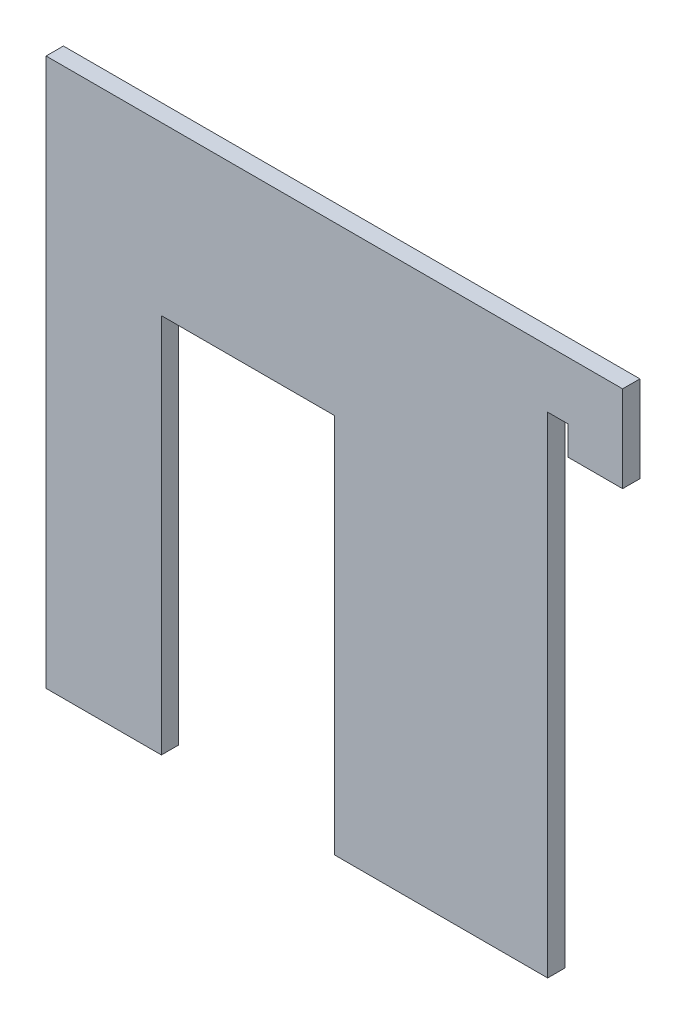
ISO-10303-21;
HEADER;
FILE_DESCRIPTION(('STEP AP214'),'2;1');
FILE_NAME('part.step','',(''),(''),'','','');
FILE_SCHEMA(('AUTOMOTIVE_DESIGN { 1 0 10303 214 1 1 1 1 }'));
ENDSEC;
DATA;
#1=APPLICATION_CONTEXT('core data for automotive mechanical design processes');
#2=APPLICATION_PROTOCOL_DEFINITION('international standard','automotive_design',2000,#1);
#3=PRODUCT_CONTEXT('',#1,'mechanical');
#4=PRODUCT('Part','Part','',(#3));
#5=PRODUCT_RELATED_PRODUCT_CATEGORY('part','',(#4));
#6=PRODUCT_DEFINITION_FORMATION('','',#4);
#7=PRODUCT_DEFINITION_CONTEXT('part definition',#1,'design');
#8=PRODUCT_DEFINITION('design','',#6,#7);
#9=PRODUCT_DEFINITION_SHAPE('','',#8);
#10=(LENGTH_UNIT() NAMED_UNIT(*) SI_UNIT(.MILLI.,.METRE.));
#11=(NAMED_UNIT(*) PLANE_ANGLE_UNIT() SI_UNIT($,.RADIAN.));
#12=(NAMED_UNIT(*) SI_UNIT($,.STERADIAN.) SOLID_ANGLE_UNIT());
#13=UNCERTAINTY_MEASURE_WITH_UNIT(LENGTH_MEASURE(1.E-05),#10,'distance_accuracy_value','');
#14=(GEOMETRIC_REPRESENTATION_CONTEXT(3) GLOBAL_UNCERTAINTY_ASSIGNED_CONTEXT((#13)) GLOBAL_UNIT_ASSIGNED_CONTEXT((#10,
#11,#12)) REPRESENTATION_CONTEXT('',''));
#15=CARTESIAN_POINT('',(0.,0.,0.));
#16=DIRECTION('',(0.,0.,1.));
#17=DIRECTION('',(1.,0.,0.));
#18=AXIS2_PLACEMENT_3D('',#15,#16,#17);
#19=CARTESIAN_POINT('',(0.,0.,3.));
#20=DIRECTION('',(0.,1.,0.));
#21=DIRECTION('',(0.,0.,1.));
#22=AXIS2_PLACEMENT_3D('',#19,#20,#21);
#23=PLANE('',#22);
#24=DIRECTION('',(1.,0.,0.));
#25=VECTOR('',#24,1.);
#26=CARTESIAN_POINT('',(0.,0.,0.));
#27=LINE('',#26,#25);
#28=CARTESIAN_POINT('',(0.,0.,0.));
#29=VERTEX_POINT('',#28);
#30=CARTESIAN_POINT('',(20.,0.,0.));
#31=VERTEX_POINT('',#30);
#32=EDGE_CURVE('E202',#29,#31,#27,.T.);
#33=ORIENTED_EDGE('',*,*,#32,.T.);
#34=DIRECTION('',(0.,0.,1.));
#35=VECTOR('',#34,1.);
#36=CARTESIAN_POINT('',(20.,0.,0.));
#37=LINE('',#36,#35);
#38=CARTESIAN_POINT('',(20.,0.,3.));
#39=VERTEX_POINT('',#38);
#40=EDGE_CURVE('E170',#31,#39,#37,.T.);
#41=ORIENTED_EDGE('',*,*,#40,.T.);
#42=DIRECTION('',(1.,0.,0.));
#43=VECTOR('',#42,1.);
#44=CARTESIAN_POINT('',(0.,0.,3.));
#45=LINE('',#44,#43);
#46=CARTESIAN_POINT('',(0.,0.,3.));
#47=VERTEX_POINT('',#46);
#48=EDGE_CURVE('E191',#47,#39,#45,.T.);
#49=ORIENTED_EDGE('',*,*,#48,.F.);
#50=DIRECTION('',(0.,0.,-1.));
#51=VECTOR('',#50,1.);
#52=CARTESIAN_POINT('',(0.,0.,3.));
#53=LINE('',#52,#51);
#54=EDGE_CURVE('E11',#47,#29,#53,.T.);
#55=ORIENTED_EDGE('',*,*,#54,.T.);
#56=EDGE_LOOP('',(#33,#41,#49,#55));
#57=FACE_BOUND('',#56,.T.);
#58=ADVANCED_FACE('F31',(#57),#23,.F.);
#59=CARTESIAN_POINT('',(0.,0.,3.));
#60=DIRECTION('',(1.,0.,0.));
#61=DIRECTION('',(0.,0.,-1.));
#62=AXIS2_PLACEMENT_3D('',#59,#60,#61);
#63=PLANE('',#62);
#64=DIRECTION('',(0.,-1.,0.));
#65=VECTOR('',#64,1.);
#66=CARTESIAN_POINT('',(0.,0.,0.));
#67=LINE('',#66,#65);
#68=CARTESIAN_POINT('',(0.,95.,0.));
#69=VERTEX_POINT('',#68);
#70=EDGE_CURVE('E179',#69,#29,#67,.T.);
#71=ORIENTED_EDGE('',*,*,#70,.T.);
#72=ORIENTED_EDGE('',*,*,#54,.F.);
#73=DIRECTION('',(0.,-1.,0.));
#74=VECTOR('',#73,1.);
#75=CARTESIAN_POINT('',(0.,0.,3.));
#76=LINE('',#75,#74);
#77=CARTESIAN_POINT('',(0.,95.,3.));
#78=VERTEX_POINT('',#77);
#79=EDGE_CURVE('E186',#78,#47,#76,.T.);
#80=ORIENTED_EDGE('',*,*,#79,.F.);
#81=DIRECTION('',(0.,0.,-1.));
#82=VECTOR('',#81,1.);
#83=CARTESIAN_POINT('',(0.,95.,3.));
#84=LINE('',#83,#82);
#85=EDGE_CURVE('E198',#78,#69,#84,.T.);
#86=ORIENTED_EDGE('',*,*,#85,.T.);
#87=EDGE_LOOP('',(#71,#72,#80,#86));
#88=FACE_BOUND('',#87,.T.);
#89=ADVANCED_FACE('F33',(#88),#63,.F.);
#90=CARTESIAN_POINT('',(50.,0.,0.));
#91=VERTEX_POINT('',#90);
#92=CARTESIAN_POINT('',(87.,0.,0.));
#93=VERTEX_POINT('',#92);
#94=EDGE_CURVE('E201',#91,#93,#27,.T.);
#95=ORIENTED_EDGE('',*,*,#94,.T.);
#96=DIRECTION('',(0.,0.,1.));
#97=VECTOR('',#96,1.);
#98=CARTESIAN_POINT('',(87.,0.,0.));
#99=LINE('',#98,#97);
#100=CARTESIAN_POINT('',(87.,0.,3.));
#101=VERTEX_POINT('',#100);
#102=EDGE_CURVE('E153',#93,#101,#99,.T.);
#103=ORIENTED_EDGE('',*,*,#102,.T.);
#104=CARTESIAN_POINT('',(50.,0.,3.));
#105=VERTEX_POINT('',#104);
#106=EDGE_CURVE('E189',#105,#101,#45,.T.);
#107=ORIENTED_EDGE('',*,*,#106,.F.);
#108=DIRECTION('',(0.,0.,1.));
#109=VECTOR('',#108,1.);
#110=CARTESIAN_POINT('',(50.,0.,0.));
#111=LINE('',#110,#109);
#112=EDGE_CURVE('E182',#91,#105,#111,.T.);
#113=ORIENTED_EDGE('',*,*,#112,.F.);
#114=EDGE_LOOP('',(#95,#103,#107,#113));
#115=FACE_BOUND('',#114,.T.);
#116=ADVANCED_FACE('F239',(#115),#23,.F.);
#117=CARTESIAN_POINT('',(100.,0.,3.));
#118=DIRECTION('',(-1.,0.,0.));
#119=DIRECTION('',(0.,0.,1.));
#120=AXIS2_PLACEMENT_3D('',#117,#118,#119);
#121=PLANE('',#120);
#122=DIRECTION('',(0.,1.,0.));
#123=VECTOR('',#122,1.);
#124=CARTESIAN_POINT('',(100.,0.,3.));
#125=LINE('',#124,#123);
#126=CARTESIAN_POINT('',(100.,80.,3.));
#127=VERTEX_POINT('',#126);
#128=CARTESIAN_POINT('',(100.,95.,3.));
#129=VERTEX_POINT('',#128);
#130=EDGE_CURVE('E194',#127,#129,#125,.T.);
#131=ORIENTED_EDGE('',*,*,#130,.F.);
#132=DIRECTION('',(0.,0.,1.));
#133=VECTOR('',#132,1.);
#134=CARTESIAN_POINT('',(100.,80.,0.));
#135=LINE('',#134,#133);
#136=CARTESIAN_POINT('',(100.,80.,0.));
#137=VERTEX_POINT('',#136);
#138=EDGE_CURVE('E157',#137,#127,#135,.T.);
#139=ORIENTED_EDGE('',*,*,#138,.F.);
#140=DIRECTION('',(0.,1.,0.));
#141=VECTOR('',#140,1.);
#142=CARTESIAN_POINT('',(100.,0.,0.));
#143=LINE('',#142,#141);
#144=CARTESIAN_POINT('',(100.,95.,0.));
#145=VERTEX_POINT('',#144);
#146=EDGE_CURVE('E205',#137,#145,#143,.T.);
#147=ORIENTED_EDGE('',*,*,#146,.T.);
#148=DIRECTION('',(0.,0.,-1.));
#149=VECTOR('',#148,1.);
#150=CARTESIAN_POINT('',(100.,95.,3.));
#151=LINE('',#150,#149);
#152=EDGE_CURVE('E39',#129,#145,#151,.T.);
#153=ORIENTED_EDGE('',*,*,#152,.F.);
#154=EDGE_LOOP('',(#131,#139,#147,#153));
#155=FACE_BOUND('',#154,.T.);
#156=ADVANCED_FACE('F227',(#155),#121,.F.);
#157=CARTESIAN_POINT('',(0.,95.,3.));
#158=DIRECTION('',(0.,-1.,0.));
#159=DIRECTION('',(0.,0.,-1.));
#160=AXIS2_PLACEMENT_3D('',#157,#158,#159);
#161=PLANE('',#160);
#162=DIRECTION('',(-1.,0.,0.));
#163=VECTOR('',#162,1.);
#164=CARTESIAN_POINT('',(0.,95.,0.));
#165=LINE('',#164,#163);
#166=EDGE_CURVE('E190',#145,#69,#165,.T.);
#167=ORIENTED_EDGE('',*,*,#166,.T.);
#168=ORIENTED_EDGE('',*,*,#85,.F.);
#169=DIRECTION('',(-1.,0.,0.));
#170=VECTOR('',#169,1.);
#171=CARTESIAN_POINT('',(0.,95.,3.));
#172=LINE('',#171,#170);
#173=EDGE_CURVE('E196',#129,#78,#172,.T.);
#174=ORIENTED_EDGE('',*,*,#173,.F.);
#175=ORIENTED_EDGE('',*,*,#152,.T.);
#176=EDGE_LOOP('',(#167,#168,#174,#175));
#177=FACE_BOUND('',#176,.T.);
#178=ADVANCED_FACE('F214',(#177),#161,.F.);
#179=CARTESIAN_POINT('',(0.,95.,3.));
#180=DIRECTION('',(0.,0.,-1.));
#181=DIRECTION('',(-1.,0.,0.));
#182=AXIS2_PLACEMENT_3D('',#179,#180,#181);
#183=PLANE('',#182);
#184=DIRECTION('',(0.,-1.,0.));
#185=VECTOR('',#184,1.);
#186=CARTESIAN_POINT('',(87.,0.,3.));
#187=LINE('',#186,#185);
#188=CARTESIAN_POINT('',(87.,85.,3.));
#189=VERTEX_POINT('',#188);
#190=EDGE_CURVE('E146',#189,#101,#187,.T.);
#191=ORIENTED_EDGE('',*,*,#190,.F.);
#192=DIRECTION('',(-1.,0.,0.));
#193=VECTOR('',#192,1.);
#194=CARTESIAN_POINT('',(87.,85.,3.));
#195=LINE('',#194,#193);
#196=CARTESIAN_POINT('',(90.5,85.,3.));
#197=VERTEX_POINT('',#196);
#198=EDGE_CURVE('E141',#197,#189,#195,.T.);
#199=ORIENTED_EDGE('',*,*,#198,.F.);
#200=DIRECTION('',(0.,1.,0.));
#201=VECTOR('',#200,1.);
#202=CARTESIAN_POINT('',(90.5,80.,3.));
#203=LINE('',#202,#201);
#204=CARTESIAN_POINT('',(90.5,80.,3.));
#205=VERTEX_POINT('',#204);
#206=EDGE_CURVE('E122',#205,#197,#203,.T.);
#207=ORIENTED_EDGE('',*,*,#206,.F.);
#208=DIRECTION('',(-1.,0.,0.));
#209=VECTOR('',#208,1.);
#210=CARTESIAN_POINT('',(87.,80.,3.));
#211=LINE('',#210,#209);
#212=EDGE_CURVE('E151',#127,#205,#211,.T.);
#213=ORIENTED_EDGE('',*,*,#212,.F.);
#214=ORIENTED_EDGE('',*,*,#130,.T.);
#215=ORIENTED_EDGE('',*,*,#173,.T.);
#216=ORIENTED_EDGE('',*,*,#79,.T.);
#217=ORIENTED_EDGE('',*,*,#48,.T.);
#218=DIRECTION('',(0.,-1.,0.));
#219=VECTOR('',#218,1.);
#220=CARTESIAN_POINT('',(20.,0.,3.));
#221=LINE('',#220,#219);
#222=CARTESIAN_POINT('',(20.,66.,3.));
#223=VERTEX_POINT('',#222);
#224=EDGE_CURVE('E159',#223,#39,#221,.T.);
#225=ORIENTED_EDGE('',*,*,#224,.F.);
#226=DIRECTION('',(-1.,0.,0.));
#227=VECTOR('',#226,1.);
#228=CARTESIAN_POINT('',(20.,66.,3.));
#229=LINE('',#228,#227);
#230=CARTESIAN_POINT('',(50.,66.,3.));
#231=VERTEX_POINT('',#230);
#232=EDGE_CURVE('E166',#231,#223,#229,.T.);
#233=ORIENTED_EDGE('',*,*,#232,.F.);
#234=DIRECTION('',(0.,1.,0.));
#235=VECTOR('',#234,1.);
#236=CARTESIAN_POINT('',(50.,0.,3.));
#237=LINE('',#236,#235);
#238=EDGE_CURVE('E172',#105,#231,#237,.T.);
#239=ORIENTED_EDGE('',*,*,#238,.F.);
#240=ORIENTED_EDGE('',*,*,#106,.T.);
#241=EDGE_LOOP('',(#191,#199,#207,#213,#214,#215,#216,#217,#225,#233,#239,#240));
#242=FACE_BOUND('',#241,.T.);
#243=ADVANCED_FACE('F223',(#242),#183,.F.);
#244=CARTESIAN_POINT('',(0.,95.,0.));
#245=DIRECTION('',(0.,0.,-1.));
#246=DIRECTION('',(-1.,0.,0.));
#247=AXIS2_PLACEMENT_3D('',#244,#245,#246);
#248=PLANE('',#247);
#249=DIRECTION('',(-1.,0.,0.));
#250=VECTOR('',#249,1.);
#251=CARTESIAN_POINT('',(87.,85.,0.));
#252=LINE('',#251,#250);
#253=CARTESIAN_POINT('',(90.5,85.,0.));
#254=VERTEX_POINT('',#253);
#255=CARTESIAN_POINT('',(87.,85.,0.));
#256=VERTEX_POINT('',#255);
#257=EDGE_CURVE('E131',#254,#256,#252,.T.);
#258=ORIENTED_EDGE('',*,*,#257,.T.);
#259=DIRECTION('',(0.,-1.,0.));
#260=VECTOR('',#259,1.);
#261=CARTESIAN_POINT('',(87.,0.,0.));
#262=LINE('',#261,#260);
#263=EDGE_CURVE('E149',#256,#93,#262,.T.);
#264=ORIENTED_EDGE('',*,*,#263,.T.);
#265=ORIENTED_EDGE('',*,*,#94,.F.);
#266=DIRECTION('',(0.,1.,0.));
#267=VECTOR('',#266,1.);
#268=CARTESIAN_POINT('',(50.,0.,0.));
#269=LINE('',#268,#267);
#270=CARTESIAN_POINT('',(50.,66.,0.));
#271=VERTEX_POINT('',#270);
#272=EDGE_CURVE('E165',#91,#271,#269,.T.);
#273=ORIENTED_EDGE('',*,*,#272,.T.);
#274=DIRECTION('',(-1.,0.,0.));
#275=VECTOR('',#274,1.);
#276=CARTESIAN_POINT('',(20.,66.,0.));
#277=LINE('',#276,#275);
#278=CARTESIAN_POINT('',(20.,66.,0.));
#279=VERTEX_POINT('',#278);
#280=EDGE_CURVE('E54',#271,#279,#277,.T.);
#281=ORIENTED_EDGE('',*,*,#280,.T.);
#282=DIRECTION('',(0.,-1.,0.));
#283=VECTOR('',#282,1.);
#284=CARTESIAN_POINT('',(20.,0.,0.));
#285=LINE('',#284,#283);
#286=EDGE_CURVE('E162',#279,#31,#285,.T.);
#287=ORIENTED_EDGE('',*,*,#286,.T.);
#288=ORIENTED_EDGE('',*,*,#32,.F.);
#289=ORIENTED_EDGE('',*,*,#70,.F.);
#290=ORIENTED_EDGE('',*,*,#166,.F.);
#291=ORIENTED_EDGE('',*,*,#146,.F.);
#292=DIRECTION('',(-1.,0.,0.));
#293=VECTOR('',#292,1.);
#294=CARTESIAN_POINT('',(87.,80.,0.));
#295=LINE('',#294,#293);
#296=CARTESIAN_POINT('',(90.5,80.,0.));
#297=VERTEX_POINT('',#296);
#298=EDGE_CURVE('E140',#137,#297,#295,.T.);
#299=ORIENTED_EDGE('',*,*,#298,.T.);
#300=DIRECTION('',(0.,1.,0.));
#301=VECTOR('',#300,1.);
#302=CARTESIAN_POINT('',(90.5,80.,0.));
#303=LINE('',#302,#301);
#304=EDGE_CURVE('E46',#297,#254,#303,.T.);
#305=ORIENTED_EDGE('',*,*,#304,.T.);
#306=EDGE_LOOP('',(#258,#264,#265,#273,#281,#287,#288,#289,#290,#291,#299,#305));
#307=FACE_BOUND('',#306,.T.);
#308=ADVANCED_FACE('F138',(#307),#248,.T.);
#309=CARTESIAN_POINT('',(20.,0.,0.));
#310=DIRECTION('',(-1.,0.,0.));
#311=DIRECTION('',(0.,0.,1.));
#312=AXIS2_PLACEMENT_3D('',#309,#310,#311);
#313=PLANE('',#312);
#314=ORIENTED_EDGE('',*,*,#224,.T.);
#315=ORIENTED_EDGE('',*,*,#40,.F.);
#316=ORIENTED_EDGE('',*,*,#286,.F.);
#317=DIRECTION('',(0.,0.,1.));
#318=VECTOR('',#317,1.);
#319=CARTESIAN_POINT('',(20.,66.,0.));
#320=LINE('',#319,#318);
#321=EDGE_CURVE('E177',#279,#223,#320,.T.);
#322=ORIENTED_EDGE('',*,*,#321,.T.);
#323=EDGE_LOOP('',(#314,#315,#316,#322));
#324=FACE_BOUND('',#323,.T.);
#325=ADVANCED_FACE('F247',(#324),#313,.F.);
#326=CARTESIAN_POINT('',(20.,66.,0.));
#327=DIRECTION('',(0.,1.,0.));
#328=DIRECTION('',(0.,0.,1.));
#329=AXIS2_PLACEMENT_3D('',#326,#327,#328);
#330=PLANE('',#329);
#331=ORIENTED_EDGE('',*,*,#232,.T.);
#332=ORIENTED_EDGE('',*,*,#321,.F.);
#333=ORIENTED_EDGE('',*,*,#280,.F.);
#334=DIRECTION('',(0.,0.,1.));
#335=VECTOR('',#334,1.);
#336=CARTESIAN_POINT('',(50.,66.,0.));
#337=LINE('',#336,#335);
#338=EDGE_CURVE('E180',#271,#231,#337,.T.);
#339=ORIENTED_EDGE('',*,*,#338,.T.);
#340=EDGE_LOOP('',(#331,#332,#333,#339));
#341=FACE_BOUND('',#340,.T.);
#342=ADVANCED_FACE('F243',(#341),#330,.F.);
#343=CARTESIAN_POINT('',(50.,0.,0.));
#344=DIRECTION('',(1.,0.,0.));
#345=DIRECTION('',(0.,0.,-1.));
#346=AXIS2_PLACEMENT_3D('',#343,#344,#345);
#347=PLANE('',#346);
#348=ORIENTED_EDGE('',*,*,#238,.T.);
#349=ORIENTED_EDGE('',*,*,#338,.F.);
#350=ORIENTED_EDGE('',*,*,#272,.F.);
#351=ORIENTED_EDGE('',*,*,#112,.T.);
#352=EDGE_LOOP('',(#348,#349,#350,#351));
#353=FACE_BOUND('',#352,.T.);
#354=ADVANCED_FACE('F241',(#353),#347,.F.);
#355=CARTESIAN_POINT('',(87.,0.,0.));
#356=DIRECTION('',(-1.,0.,0.));
#357=DIRECTION('',(0.,0.,1.));
#358=AXIS2_PLACEMENT_3D('',#355,#356,#357);
#359=PLANE('',#358);
#360=ORIENTED_EDGE('',*,*,#190,.T.);
#361=ORIENTED_EDGE('',*,*,#102,.F.);
#362=ORIENTED_EDGE('',*,*,#263,.F.);
#363=DIRECTION('',(0.,0.,1.));
#364=VECTOR('',#363,1.);
#365=CARTESIAN_POINT('',(87.,85.,0.));
#366=LINE('',#365,#364);
#367=EDGE_CURVE('E126',#256,#189,#366,.T.);
#368=ORIENTED_EDGE('',*,*,#367,.T.);
#369=EDGE_LOOP('',(#360,#361,#362,#368));
#370=FACE_BOUND('',#369,.T.);
#371=ADVANCED_FACE('F234',(#370),#359,.F.);
#372=CARTESIAN_POINT('',(87.,80.,0.));
#373=DIRECTION('',(0.,1.,0.));
#374=DIRECTION('',(0.,0.,1.));
#375=AXIS2_PLACEMENT_3D('',#372,#373,#374);
#376=PLANE('',#375);
#377=ORIENTED_EDGE('',*,*,#212,.T.);
#378=DIRECTION('',(0.,0.,1.));
#379=VECTOR('',#378,1.);
#380=CARTESIAN_POINT('',(90.5,80.,0.));
#381=LINE('',#380,#379);
#382=EDGE_CURVE('E127',#297,#205,#381,.T.);
#383=ORIENTED_EDGE('',*,*,#382,.F.);
#384=ORIENTED_EDGE('',*,*,#298,.F.);
#385=ORIENTED_EDGE('',*,*,#138,.T.);
#386=EDGE_LOOP('',(#377,#383,#384,#385));
#387=FACE_BOUND('',#386,.T.);
#388=ADVANCED_FACE('F229',(#387),#376,.F.);
#389=CARTESIAN_POINT('',(87.,85.,0.));
#390=DIRECTION('',(0.,1.,0.));
#391=DIRECTION('',(0.,0.,1.));
#392=AXIS2_PLACEMENT_3D('',#389,#390,#391);
#393=PLANE('',#392);
#394=ORIENTED_EDGE('',*,*,#198,.T.);
#395=ORIENTED_EDGE('',*,*,#367,.F.);
#396=ORIENTED_EDGE('',*,*,#257,.F.);
#397=DIRECTION('',(0.,0.,1.));
#398=VECTOR('',#397,1.);
#399=CARTESIAN_POINT('',(90.5,85.,0.));
#400=LINE('',#399,#398);
#401=EDGE_CURVE('E118',#254,#197,#400,.T.);
#402=ORIENTED_EDGE('',*,*,#401,.T.);
#403=EDGE_LOOP('',(#394,#395,#396,#402));
#404=FACE_BOUND('',#403,.T.);
#405=ADVANCED_FACE('F132',(#404),#393,.F.);
#406=CARTESIAN_POINT('',(90.5,80.,0.));
#407=DIRECTION('',(1.,0.,0.));
#408=DIRECTION('',(0.,0.,-1.));
#409=AXIS2_PLACEMENT_3D('',#406,#407,#408);
#410=PLANE('',#409);
#411=ORIENTED_EDGE('',*,*,#206,.T.);
#412=ORIENTED_EDGE('',*,*,#401,.F.);
#413=ORIENTED_EDGE('',*,*,#304,.F.);
#414=ORIENTED_EDGE('',*,*,#382,.T.);
#415=EDGE_LOOP('',(#411,#412,#413,#414));
#416=FACE_BOUND('',#415,.T.);
#417=ADVANCED_FACE('F120',(#416),#410,.F.);
#418=CLOSED_SHELL('',(#58,#89,#116,#156,#178,#243,#308,#325,#342,#354,#371,#388,#405,#417));
#419=MANIFOLD_SOLID_BREP('B2',#418);
#420=ADVANCED_BREP_SHAPE_REPRESENTATION('',(#18,#419),#14);
#421=SHAPE_DEFINITION_REPRESENTATION(#9,#420);
ENDSEC;
END-ISO-10303-21;
